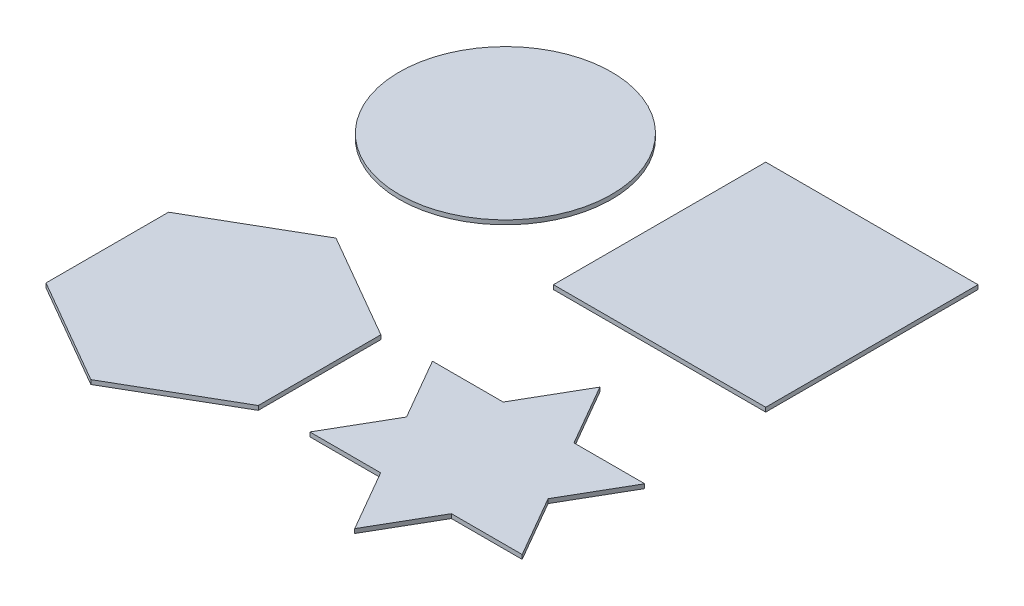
ISO-10303-21;
HEADER;
FILE_DESCRIPTION(('STEP AP214'),'2;1');
FILE_NAME('part.step','',(''),(''),'','','');
FILE_SCHEMA(('AUTOMOTIVE_DESIGN { 1 0 10303 214 1 1 1 1 }'));
ENDSEC;
DATA;
#1=APPLICATION_CONTEXT('core data for automotive mechanical design processes');
#2=APPLICATION_PROTOCOL_DEFINITION('international standard','automotive_design',2000,#1);
#3=PRODUCT_CONTEXT('',#1,'mechanical');
#4=PRODUCT('Part','Part','',(#3));
#5=PRODUCT_RELATED_PRODUCT_CATEGORY('part','',(#4));
#6=PRODUCT_DEFINITION_FORMATION('','',#4);
#7=PRODUCT_DEFINITION_CONTEXT('part definition',#1,'design');
#8=PRODUCT_DEFINITION('design','',#6,#7);
#9=PRODUCT_DEFINITION_SHAPE('','',#8);
#10=(LENGTH_UNIT() NAMED_UNIT(*) SI_UNIT(.MILLI.,.METRE.));
#11=(NAMED_UNIT(*) PLANE_ANGLE_UNIT() SI_UNIT($,.RADIAN.));
#12=(NAMED_UNIT(*) SI_UNIT($,.STERADIAN.) SOLID_ANGLE_UNIT());
#13=UNCERTAINTY_MEASURE_WITH_UNIT(LENGTH_MEASURE(1.E-05),#10,'distance_accuracy_value','');
#14=(GEOMETRIC_REPRESENTATION_CONTEXT(3) GLOBAL_UNCERTAINTY_ASSIGNED_CONTEXT((#13)) GLOBAL_UNIT_ASSIGNED_CONTEXT((#10,
#11,#12)) REPRESENTATION_CONTEXT('',''));
#15=CARTESIAN_POINT('',(0.,0.,0.));
#16=DIRECTION('',(0.,0.,1.));
#17=DIRECTION('',(1.,0.,0.));
#18=AXIS2_PLACEMENT_3D('',#15,#16,#17);
#19=CARTESIAN_POINT('',(62.9014881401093,1.,40.6539728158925));
#20=DIRECTION('',(0.866025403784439,0.,0.5));
#21=DIRECTION('',(0.5,0.,-0.866025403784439));
#22=AXIS2_PLACEMENT_3D('',#19,#20,#21);
#23=PLANE('',#22);
#24=DIRECTION('',(-0.5,0.,0.866025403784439));
#25=VECTOR('',#24,1.);
#26=CARTESIAN_POINT('',(62.9014881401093,0.,40.6539728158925));
#27=LINE('',#26,#25);
#28=CARTESIAN_POINT('',(62.9014881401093,0.,40.6539728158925));
#29=VERTEX_POINT('',#28);
#30=CARTESIAN_POINT('',(54.568154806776,0.,55.0877295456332));
#31=VERTEX_POINT('',#30);
#32=EDGE_CURVE('E162',#29,#31,#27,.T.);
#33=ORIENTED_EDGE('',*,*,#32,.T.);
#34=DIRECTION('',(0.,-1.,0.));
#35=VECTOR('',#34,1.);
#36=CARTESIAN_POINT('',(54.568154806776,1.,55.0877295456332));
#37=LINE('',#36,#35);
#38=CARTESIAN_POINT('',(54.568154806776,1.,55.0877295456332));
#39=VERTEX_POINT('',#38);
#40=EDGE_CURVE('E12',#39,#31,#37,.T.);
#41=ORIENTED_EDGE('',*,*,#40,.F.);
#42=DIRECTION('',(-0.5,0.,0.866025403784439));
#43=VECTOR('',#42,1.);
#44=CARTESIAN_POINT('',(62.9014881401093,1.,40.6539728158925));
#45=LINE('',#44,#43);
#46=CARTESIAN_POINT('',(62.9014881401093,1.,40.6539728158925));
#47=VERTEX_POINT('',#46);
#48=EDGE_CURVE('E184',#47,#39,#45,.T.);
#49=ORIENTED_EDGE('',*,*,#48,.F.);
#50=DIRECTION('',(0.,-1.,0.));
#51=VECTOR('',#50,1.);
#52=CARTESIAN_POINT('',(62.9014881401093,1.,40.6539728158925));
#53=LINE('',#52,#51);
#54=EDGE_CURVE('E158',#47,#29,#53,.T.);
#55=ORIENTED_EDGE('',*,*,#54,.T.);
#56=EDGE_LOOP('',(#33,#41,#49,#55));
#57=FACE_BOUND('',#56,.T.);
#58=ADVANCED_FACE('F42',(#57),#23,.F.);
#59=CARTESIAN_POINT('',(37.9014881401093,1.,55.0877295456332));
#60=DIRECTION('',(0.,0.,1.));
#61=DIRECTION('',(1.,0.,0.));
#62=AXIS2_PLACEMENT_3D('',#59,#60,#61);
#63=PLANE('',#62);
#64=DIRECTION('',(-1.,0.,0.));
#65=VECTOR('',#64,1.);
#66=CARTESIAN_POINT('',(37.9014881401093,0.,55.0877295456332));
#67=LINE('',#66,#65);
#68=CARTESIAN_POINT('',(37.9014881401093,0.,55.0877295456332));
#69=VERTEX_POINT('',#68);
#70=EDGE_CURVE('E165',#31,#69,#67,.T.);
#71=ORIENTED_EDGE('',*,*,#70,.T.);
#72=DIRECTION('',(0.,-1.,0.));
#73=VECTOR('',#72,1.);
#74=CARTESIAN_POINT('',(37.9014881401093,1.,55.0877295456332));
#75=LINE('',#74,#73);
#76=CARTESIAN_POINT('',(37.9014881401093,1.,55.0877295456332));
#77=VERTEX_POINT('',#76);
#78=EDGE_CURVE('E50',#77,#69,#75,.T.);
#79=ORIENTED_EDGE('',*,*,#78,.F.);
#80=DIRECTION('',(-1.,0.,0.));
#81=VECTOR('',#80,1.);
#82=CARTESIAN_POINT('',(37.9014881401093,1.,55.0877295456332));
#83=LINE('',#82,#81);
#84=EDGE_CURVE('E113',#39,#77,#83,.T.);
#85=ORIENTED_EDGE('',*,*,#84,.F.);
#86=ORIENTED_EDGE('',*,*,#40,.T.);
#87=EDGE_LOOP('',(#71,#79,#85,#86));
#88=FACE_BOUND('',#87,.T.);
#89=ADVANCED_FACE('F262',(#88),#63,.F.);
#90=CARTESIAN_POINT('',(37.9014881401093,1.,55.0877295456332));
#91=DIRECTION('',(0.866025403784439,0.,-0.5));
#92=DIRECTION('',(-0.5,0.,-0.866025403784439));
#93=AXIS2_PLACEMENT_3D('',#90,#91,#92);
#94=PLANE('',#93);
#95=DIRECTION('',(0.5,0.,0.866025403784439));
#96=VECTOR('',#95,1.);
#97=CARTESIAN_POINT('',(37.9014881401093,0.,55.0877295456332));
#98=LINE('',#97,#96);
#99=CARTESIAN_POINT('',(46.2348214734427,0.,69.5214862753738));
#100=VERTEX_POINT('',#99);
#101=EDGE_CURVE('E167',#69,#100,#98,.T.);
#102=ORIENTED_EDGE('',*,*,#101,.T.);
#103=DIRECTION('',(0.,-1.,0.));
#104=VECTOR('',#103,1.);
#105=CARTESIAN_POINT('',(46.2348214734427,1.,69.5214862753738));
#106=LINE('',#105,#104);
#107=CARTESIAN_POINT('',(46.2348214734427,1.,69.5214862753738));
#108=VERTEX_POINT('',#107);
#109=EDGE_CURVE('E203',#108,#100,#106,.T.);
#110=ORIENTED_EDGE('',*,*,#109,.F.);
#111=DIRECTION('',(0.5,0.,0.866025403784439));
#112=VECTOR('',#111,1.);
#113=CARTESIAN_POINT('',(37.9014881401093,1.,55.0877295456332));
#114=LINE('',#113,#112);
#115=EDGE_CURVE('E211',#77,#108,#114,.T.);
#116=ORIENTED_EDGE('',*,*,#115,.F.);
#117=ORIENTED_EDGE('',*,*,#78,.T.);
#118=EDGE_LOOP('',(#102,#110,#116,#117));
#119=FACE_BOUND('',#118,.T.);
#120=ADVANCED_FACE('F209',(#119),#94,.F.);
#121=CARTESIAN_POINT('',(46.2348214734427,1.,69.5214862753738));
#122=DIRECTION('',(0.866025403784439,0.,0.5));
#123=DIRECTION('',(0.5,0.,-0.866025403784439));
#124=AXIS2_PLACEMENT_3D('',#121,#122,#123);
#125=PLANE('',#124);
#126=DIRECTION('',(-0.5,0.,0.866025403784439));
#127=VECTOR('',#126,1.);
#128=CARTESIAN_POINT('',(46.2348214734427,0.,69.5214862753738));
#129=LINE('',#128,#127);
#130=CARTESIAN_POINT('',(37.9014881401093,0.,83.9552430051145));
#131=VERTEX_POINT('',#130);
#132=EDGE_CURVE('E169',#100,#131,#129,.T.);
#133=ORIENTED_EDGE('',*,*,#132,.T.);
#134=DIRECTION('',(0.,-1.,0.));
#135=VECTOR('',#134,1.);
#136=CARTESIAN_POINT('',(37.9014881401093,1.,83.9552430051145));
#137=LINE('',#136,#135);
#138=CARTESIAN_POINT('',(37.9014881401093,1.,83.9552430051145));
#139=VERTEX_POINT('',#138);
#140=EDGE_CURVE('E200',#139,#131,#137,.T.);
#141=ORIENTED_EDGE('',*,*,#140,.F.);
#142=DIRECTION('',(-0.5,0.,0.866025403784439));
#143=VECTOR('',#142,1.);
#144=CARTESIAN_POINT('',(46.2348214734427,1.,69.5214862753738));
#145=LINE('',#144,#143);
#146=EDGE_CURVE('E229',#108,#139,#145,.T.);
#147=ORIENTED_EDGE('',*,*,#146,.F.);
#148=ORIENTED_EDGE('',*,*,#109,.T.);
#149=EDGE_LOOP('',(#133,#141,#147,#148));
#150=FACE_BOUND('',#149,.T.);
#151=ADVANCED_FACE('F220',(#150),#125,.F.);
#152=CARTESIAN_POINT('',(37.9014881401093,1.,83.9552430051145));
#153=DIRECTION('',(0.,0.,-1.));
#154=DIRECTION('',(-1.,0.,0.));
#155=AXIS2_PLACEMENT_3D('',#152,#153,#154);
#156=PLANE('',#155);
#157=DIRECTION('',(1.,0.,0.));
#158=VECTOR('',#157,1.);
#159=CARTESIAN_POINT('',(37.9014881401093,0.,83.9552430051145));
#160=LINE('',#159,#158);
#161=CARTESIAN_POINT('',(54.568154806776,0.,83.9552430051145));
#162=VERTEX_POINT('',#161);
#163=EDGE_CURVE('E171',#131,#162,#160,.T.);
#164=ORIENTED_EDGE('',*,*,#163,.T.);
#165=DIRECTION('',(0.,-1.,0.));
#166=VECTOR('',#165,1.);
#167=CARTESIAN_POINT('',(54.568154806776,1.,83.9552430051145));
#168=LINE('',#167,#166);
#169=CARTESIAN_POINT('',(54.568154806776,1.,83.9552430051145));
#170=VERTEX_POINT('',#169);
#171=EDGE_CURVE('E197',#170,#162,#168,.T.);
#172=ORIENTED_EDGE('',*,*,#171,.F.);
#173=DIRECTION('',(1.,0.,0.));
#174=VECTOR('',#173,1.);
#175=CARTESIAN_POINT('',(37.9014881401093,1.,83.9552430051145));
#176=LINE('',#175,#174);
#177=EDGE_CURVE('E226',#139,#170,#176,.T.);
#178=ORIENTED_EDGE('',*,*,#177,.F.);
#179=ORIENTED_EDGE('',*,*,#140,.T.);
#180=EDGE_LOOP('',(#164,#172,#178,#179));
#181=FACE_BOUND('',#180,.T.);
#182=ADVANCED_FACE('F224',(#181),#156,.F.);
#183=CARTESIAN_POINT('',(54.568154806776,1.,83.9552430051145));
#184=DIRECTION('',(0.866025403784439,0.,-0.5));
#185=DIRECTION('',(-0.5,0.,-0.866025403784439));
#186=AXIS2_PLACEMENT_3D('',#183,#184,#185);
#187=PLANE('',#186);
#188=DIRECTION('',(0.5,0.,0.866025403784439));
#189=VECTOR('',#188,1.);
#190=CARTESIAN_POINT('',(54.568154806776,0.,83.9552430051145));
#191=LINE('',#190,#189);
#192=CARTESIAN_POINT('',(62.9014881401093,0.,98.3889997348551));
#193=VERTEX_POINT('',#192);
#194=EDGE_CURVE('E173',#162,#193,#191,.T.);
#195=ORIENTED_EDGE('',*,*,#194,.T.);
#196=DIRECTION('',(0.,-1.,0.));
#197=VECTOR('',#196,1.);
#198=CARTESIAN_POINT('',(62.9014881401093,1.,98.3889997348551));
#199=LINE('',#198,#197);
#200=CARTESIAN_POINT('',(62.9014881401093,1.,98.3889997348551));
#201=VERTEX_POINT('',#200);
#202=EDGE_CURVE('E194',#201,#193,#199,.T.);
#203=ORIENTED_EDGE('',*,*,#202,.F.);
#204=DIRECTION('',(0.5,0.,0.866025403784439));
#205=VECTOR('',#204,1.);
#206=CARTESIAN_POINT('',(54.568154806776,1.,83.9552430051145));
#207=LINE('',#206,#205);
#208=EDGE_CURVE('E228',#170,#201,#207,.T.);
#209=ORIENTED_EDGE('',*,*,#208,.F.);
#210=ORIENTED_EDGE('',*,*,#171,.T.);
#211=EDGE_LOOP('',(#195,#203,#209,#210));
#212=FACE_BOUND('',#211,.T.);
#213=ADVANCED_FACE('F275',(#212),#187,.F.);
#214=CARTESIAN_POINT('',(71.2348214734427,1.,83.9552430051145));
#215=DIRECTION('',(-0.866025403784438,0.,-0.5));
#216=DIRECTION('',(-0.5,0.,0.866025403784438));
#217=AXIS2_PLACEMENT_3D('',#214,#215,#216);
#218=PLANE('',#217);
#219=DIRECTION('',(0.5,0.,-0.866025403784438));
#220=VECTOR('',#219,1.);
#221=CARTESIAN_POINT('',(71.2348214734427,0.,83.9552430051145));
#222=LINE('',#221,#220);
#223=CARTESIAN_POINT('',(71.2348214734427,0.,83.9552430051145));
#224=VERTEX_POINT('',#223);
#225=EDGE_CURVE('E175',#193,#224,#222,.T.);
#226=ORIENTED_EDGE('',*,*,#225,.T.);
#227=DIRECTION('',(0.,-1.,0.));
#228=VECTOR('',#227,1.);
#229=CARTESIAN_POINT('',(71.2348214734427,1.,83.9552430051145));
#230=LINE('',#229,#228);
#231=CARTESIAN_POINT('',(71.2348214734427,1.,83.9552430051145));
#232=VERTEX_POINT('',#231);
#233=EDGE_CURVE('E191',#232,#224,#230,.T.);
#234=ORIENTED_EDGE('',*,*,#233,.F.);
#235=DIRECTION('',(0.5,0.,-0.866025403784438));
#236=VECTOR('',#235,1.);
#237=CARTESIAN_POINT('',(71.2348214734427,1.,83.9552430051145));
#238=LINE('',#237,#236);
#239=EDGE_CURVE('E231',#201,#232,#238,.T.);
#240=ORIENTED_EDGE('',*,*,#239,.F.);
#241=ORIENTED_EDGE('',*,*,#202,.T.);
#242=EDGE_LOOP('',(#226,#234,#240,#241));
#243=FACE_BOUND('',#242,.T.);
#244=ADVANCED_FACE('F278',(#243),#218,.F.);
#245=CARTESIAN_POINT('',(71.2348214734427,1.,83.9552430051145));
#246=DIRECTION('',(0.,0.,-1.));
#247=DIRECTION('',(-1.,0.,0.));
#248=AXIS2_PLACEMENT_3D('',#245,#246,#247);
#249=PLANE('',#248);
#250=DIRECTION('',(1.,0.,0.));
#251=VECTOR('',#250,1.);
#252=CARTESIAN_POINT('',(71.2348214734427,0.,83.9552430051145));
#253=LINE('',#252,#251);
#254=CARTESIAN_POINT('',(87.9014881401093,0.,83.9552430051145));
#255=VERTEX_POINT('',#254);
#256=EDGE_CURVE('E177',#224,#255,#253,.T.);
#257=ORIENTED_EDGE('',*,*,#256,.T.);
#258=DIRECTION('',(0.,-1.,0.));
#259=VECTOR('',#258,1.);
#260=CARTESIAN_POINT('',(87.9014881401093,1.,83.9552430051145));
#261=LINE('',#260,#259);
#262=CARTESIAN_POINT('',(87.9014881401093,1.,83.9552430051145));
#263=VERTEX_POINT('',#262);
#264=EDGE_CURVE('E188',#263,#255,#261,.T.);
#265=ORIENTED_EDGE('',*,*,#264,.F.);
#266=DIRECTION('',(1.,0.,0.));
#267=VECTOR('',#266,1.);
#268=CARTESIAN_POINT('',(71.2348214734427,1.,83.9552430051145));
#269=LINE('',#268,#267);
#270=EDGE_CURVE('E237',#232,#263,#269,.T.);
#271=ORIENTED_EDGE('',*,*,#270,.F.);
#272=ORIENTED_EDGE('',*,*,#233,.T.);
#273=EDGE_LOOP('',(#257,#265,#271,#272));
#274=FACE_BOUND('',#273,.T.);
#275=ADVANCED_FACE('F243',(#274),#249,.F.);
#276=CARTESIAN_POINT('',(79.568154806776,1.,69.5214862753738));
#277=DIRECTION('',(-0.866025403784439,0.,0.499999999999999));
#278=DIRECTION('',(0.499999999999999,0.,0.866025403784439));
#279=AXIS2_PLACEMENT_3D('',#276,#277,#278);
#280=PLANE('',#279);
#281=DIRECTION('',(-0.5,0.,-0.866025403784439));
#282=VECTOR('',#281,1.);
#283=CARTESIAN_POINT('',(79.568154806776,0.,69.5214862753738));
#284=LINE('',#283,#282);
#285=CARTESIAN_POINT('',(79.568154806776,0.,69.5214862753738));
#286=VERTEX_POINT('',#285);
#287=EDGE_CURVE('E179',#255,#286,#284,.T.);
#288=ORIENTED_EDGE('',*,*,#287,.T.);
#289=DIRECTION('',(0.,-1.,0.));
#290=VECTOR('',#289,1.);
#291=CARTESIAN_POINT('',(79.568154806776,1.,69.5214862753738));
#292=LINE('',#291,#290);
#293=CARTESIAN_POINT('',(79.568154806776,1.,69.5214862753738));
#294=VERTEX_POINT('',#293);
#295=EDGE_CURVE('E153',#294,#286,#292,.T.);
#296=ORIENTED_EDGE('',*,*,#295,.F.);
#297=DIRECTION('',(-0.5,0.,-0.866025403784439));
#298=VECTOR('',#297,1.);
#299=CARTESIAN_POINT('',(79.568154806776,1.,69.5214862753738));
#300=LINE('',#299,#298);
#301=EDGE_CURVE('E144',#263,#294,#300,.T.);
#302=ORIENTED_EDGE('',*,*,#301,.F.);
#303=ORIENTED_EDGE('',*,*,#264,.T.);
#304=EDGE_LOOP('',(#288,#296,#302,#303));
#305=FACE_BOUND('',#304,.T.);
#306=ADVANCED_FACE('F247',(#305),#280,.F.);
#307=CARTESIAN_POINT('',(87.9014881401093,1.,55.0877295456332));
#308=DIRECTION('',(-0.866025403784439,0.,-0.5));
#309=DIRECTION('',(-0.5,0.,0.866025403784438));
#310=AXIS2_PLACEMENT_3D('',#307,#308,#309);
#311=PLANE('',#310);
#312=DIRECTION('',(0.5,0.,-0.866025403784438));
#313=VECTOR('',#312,1.);
#314=CARTESIAN_POINT('',(87.9014881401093,0.,55.0877295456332));
#315=LINE('',#314,#313);
#316=CARTESIAN_POINT('',(87.9014881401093,0.,55.0877295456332));
#317=VERTEX_POINT('',#316);
#318=EDGE_CURVE('E152',#286,#317,#315,.T.);
#319=ORIENTED_EDGE('',*,*,#318,.T.);
#320=DIRECTION('',(0.,-1.,0.));
#321=VECTOR('',#320,1.);
#322=CARTESIAN_POINT('',(87.9014881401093,1.,55.0877295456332));
#323=LINE('',#322,#321);
#324=CARTESIAN_POINT('',(87.9014881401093,1.,55.0877295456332));
#325=VERTEX_POINT('',#324);
#326=EDGE_CURVE('E149',#325,#317,#323,.T.);
#327=ORIENTED_EDGE('',*,*,#326,.F.);
#328=DIRECTION('',(0.5,0.,-0.866025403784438));
#329=VECTOR('',#328,1.);
#330=CARTESIAN_POINT('',(87.9014881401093,1.,55.0877295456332));
#331=LINE('',#330,#329);
#332=EDGE_CURVE('E138',#294,#325,#331,.T.);
#333=ORIENTED_EDGE('',*,*,#332,.F.);
#334=ORIENTED_EDGE('',*,*,#295,.T.);
#335=EDGE_LOOP('',(#319,#327,#333,#334));
#336=FACE_BOUND('',#335,.T.);
#337=ADVANCED_FACE('F150',(#336),#311,.F.);
#338=CARTESIAN_POINT('',(71.2348214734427,1.,55.0877295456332));
#339=DIRECTION('',(0.,0.,1.));
#340=DIRECTION('',(1.,0.,0.));
#341=AXIS2_PLACEMENT_3D('',#338,#339,#340);
#342=PLANE('',#341);
#343=DIRECTION('',(-1.,0.,0.));
#344=VECTOR('',#343,1.);
#345=CARTESIAN_POINT('',(71.2348214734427,0.,55.0877295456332));
#346=LINE('',#345,#344);
#347=CARTESIAN_POINT('',(71.2348214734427,0.,55.0877295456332));
#348=VERTEX_POINT('',#347);
#349=EDGE_CURVE('E99',#317,#348,#346,.T.);
#350=ORIENTED_EDGE('',*,*,#349,.T.);
#351=DIRECTION('',(0.,-1.,0.));
#352=VECTOR('',#351,1.);
#353=CARTESIAN_POINT('',(71.2348214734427,1.,55.0877295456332));
#354=LINE('',#353,#352);
#355=CARTESIAN_POINT('',(71.2348214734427,1.,55.0877295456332));
#356=VERTEX_POINT('',#355);
#357=EDGE_CURVE('E154',#356,#348,#354,.T.);
#358=ORIENTED_EDGE('',*,*,#357,.F.);
#359=DIRECTION('',(-1.,0.,0.));
#360=VECTOR('',#359,1.);
#361=CARTESIAN_POINT('',(71.2348214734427,1.,55.0877295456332));
#362=LINE('',#361,#360);
#363=EDGE_CURVE('E142',#325,#356,#362,.T.);
#364=ORIENTED_EDGE('',*,*,#363,.F.);
#365=ORIENTED_EDGE('',*,*,#326,.T.);
#366=EDGE_LOOP('',(#350,#358,#364,#365));
#367=FACE_BOUND('',#366,.T.);
#368=ADVANCED_FACE('F156',(#367),#342,.F.);
#369=CARTESIAN_POINT('',(62.9014881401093,1.,40.6539728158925));
#370=DIRECTION('',(-0.866025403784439,0.,0.5));
#371=DIRECTION('',(0.5,0.,0.866025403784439));
#372=AXIS2_PLACEMENT_3D('',#369,#370,#371);
#373=PLANE('',#372);
#374=DIRECTION('',(-0.5,0.,-0.866025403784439));
#375=VECTOR('',#374,1.);
#376=CARTESIAN_POINT('',(62.9014881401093,0.,40.6539728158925));
#377=LINE('',#376,#375);
#378=EDGE_CURVE('E105',#348,#29,#377,.T.);
#379=ORIENTED_EDGE('',*,*,#378,.T.);
#380=ORIENTED_EDGE('',*,*,#54,.F.);
#381=DIRECTION('',(-0.5,0.,-0.866025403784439));
#382=VECTOR('',#381,1.);
#383=CARTESIAN_POINT('',(62.9014881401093,1.,40.6539728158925));
#384=LINE('',#383,#382);
#385=EDGE_CURVE('E58',#356,#47,#384,.T.);
#386=ORIENTED_EDGE('',*,*,#385,.F.);
#387=ORIENTED_EDGE('',*,*,#357,.T.);
#388=EDGE_LOOP('',(#379,#380,#386,#387));
#389=FACE_BOUND('',#388,.T.);
#390=ADVANCED_FACE('F251',(#389),#373,.F.);
#391=CARTESIAN_POINT('',(54.568154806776,1.,55.0877295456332));
#392=DIRECTION('',(0.,1.,0.));
#393=DIRECTION('',(0.,0.,1.));
#394=AXIS2_PLACEMENT_3D('',#391,#392,#393);
#395=PLANE('',#394);
#396=ORIENTED_EDGE('',*,*,#48,.T.);
#397=ORIENTED_EDGE('',*,*,#84,.T.);
#398=ORIENTED_EDGE('',*,*,#115,.T.);
#399=ORIENTED_EDGE('',*,*,#146,.T.);
#400=ORIENTED_EDGE('',*,*,#177,.T.);
#401=ORIENTED_EDGE('',*,*,#208,.T.);
#402=ORIENTED_EDGE('',*,*,#239,.T.);
#403=ORIENTED_EDGE('',*,*,#270,.T.);
#404=ORIENTED_EDGE('',*,*,#301,.T.);
#405=ORIENTED_EDGE('',*,*,#332,.T.);
#406=ORIENTED_EDGE('',*,*,#363,.T.);
#407=ORIENTED_EDGE('',*,*,#385,.T.);
#408=EDGE_LOOP('',(#396,#397,#398,#399,#400,#401,#402,#403,#404,#405,#406,#407));
#409=FACE_BOUND('',#408,.T.);
#410=ADVANCED_FACE('F140',(#409),#395,.T.);
#411=CARTESIAN_POINT('',(54.568154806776,0.,55.0877295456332));
#412=DIRECTION('',(0.,1.,0.));
#413=DIRECTION('',(0.,0.,1.));
#414=AXIS2_PLACEMENT_3D('',#411,#412,#413);
#415=PLANE('',#414);
#416=ORIENTED_EDGE('',*,*,#32,.F.);
#417=ORIENTED_EDGE('',*,*,#378,.F.);
#418=ORIENTED_EDGE('',*,*,#349,.F.);
#419=ORIENTED_EDGE('',*,*,#318,.F.);
#420=ORIENTED_EDGE('',*,*,#287,.F.);
#421=ORIENTED_EDGE('',*,*,#256,.F.);
#422=ORIENTED_EDGE('',*,*,#225,.F.);
#423=ORIENTED_EDGE('',*,*,#194,.F.);
#424=ORIENTED_EDGE('',*,*,#163,.F.);
#425=ORIENTED_EDGE('',*,*,#132,.F.);
#426=ORIENTED_EDGE('',*,*,#101,.F.);
#427=ORIENTED_EDGE('',*,*,#70,.F.);
#428=EDGE_LOOP('',(#416,#417,#418,#419,#420,#421,#422,#423,#424,#425,#426,#427));
#429=FACE_BOUND('',#428,.T.);
#430=ADVANCED_FACE('F215',(#429),#415,.F.);
#431=CLOSED_SHELL('',(#58,#89,#120,#151,#182,#213,#244,#275,#306,#337,#368,#390,#410,#430));
#432=MANIFOLD_SOLID_BREP('B2',#431);
#433=CARTESIAN_POINT('',(26.4283937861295,1.,55.7690727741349));
#434=DIRECTION('',(-0.5,0.,0.866025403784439));
#435=DIRECTION('',(0.866025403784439,0.,0.5));
#436=AXIS2_PLACEMENT_3D('',#433,#434,#435);
#437=PLANE('',#436);
#438=DIRECTION('',(-0.866025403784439,0.,-0.5));
#439=VECTOR('',#438,1.);
#440=CARTESIAN_POINT('',(26.4283937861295,0.,55.7690727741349));
#441=LINE('',#440,#439);
#442=CARTESIAN_POINT('',(26.4283937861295,0.,55.7690727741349));
#443=VERTEX_POINT('',#442);
#444=CARTESIAN_POINT('',(1.42839378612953,0.,41.3353160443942));
#445=VERTEX_POINT('',#444);
#446=EDGE_CURVE('E468',#443,#445,#441,.T.);
#447=ORIENTED_EDGE('',*,*,#446,.T.);
#448=DIRECTION('',(0.,-1.,0.));
#449=VECTOR('',#448,1.);
#450=CARTESIAN_POINT('',(1.42839378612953,1.,41.3353160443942));
#451=LINE('',#450,#449);
#452=CARTESIAN_POINT('',(1.42839378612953,1.,41.3353160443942));
#453=VERTEX_POINT('',#452);
#454=EDGE_CURVE('E40',#453,#445,#451,.T.);
#455=ORIENTED_EDGE('',*,*,#454,.F.);
#456=DIRECTION('',(-0.866025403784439,0.,-0.5));
#457=VECTOR('',#456,1.);
#458=CARTESIAN_POINT('',(26.4283937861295,1.,55.7690727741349));
#459=LINE('',#458,#457);
#460=CARTESIAN_POINT('',(26.4283937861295,1.,55.7690727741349));
#461=VERTEX_POINT('',#460);
#462=EDGE_CURVE('E478',#461,#453,#459,.T.);
#463=ORIENTED_EDGE('',*,*,#462,.F.);
#464=DIRECTION('',(0.,-1.,0.));
#465=VECTOR('',#464,1.);
#466=CARTESIAN_POINT('',(26.4283937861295,1.,55.7690727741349));
#467=LINE('',#466,#465);
#468=EDGE_CURVE('E464',#461,#443,#467,.T.);
#469=ORIENTED_EDGE('',*,*,#468,.T.);
#470=EDGE_LOOP('',(#447,#455,#463,#469));
#471=FACE_BOUND('',#470,.T.);
#472=ADVANCED_FACE('F384',(#471),#437,.F.);
#473=CARTESIAN_POINT('',(1.42839378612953,1.,41.3353160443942));
#474=DIRECTION('',(0.5,0.,0.866025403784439));
#475=DIRECTION('',(0.866025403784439,0.,-0.5));
#476=AXIS2_PLACEMENT_3D('',#473,#474,#475);
#477=PLANE('',#476);
#478=DIRECTION('',(-0.866025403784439,0.,0.5));
#479=VECTOR('',#478,1.);
#480=CARTESIAN_POINT('',(1.42839378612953,0.,41.3353160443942));
#481=LINE('',#480,#479);
#482=CARTESIAN_POINT('',(-23.5716062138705,0.,55.7690727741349));
#483=VERTEX_POINT('',#482);
#484=EDGE_CURVE('E471',#445,#483,#481,.T.);
#485=ORIENTED_EDGE('',*,*,#484,.T.);
#486=DIRECTION('',(0.,-1.,0.));
#487=VECTOR('',#486,1.);
#488=CARTESIAN_POINT('',(-23.5716062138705,1.,55.7690727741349));
#489=LINE('',#488,#487);
#490=CARTESIAN_POINT('',(-23.5716062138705,1.,55.7690727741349));
#491=VERTEX_POINT('',#490);
#492=EDGE_CURVE('E392',#491,#483,#489,.T.);
#493=ORIENTED_EDGE('',*,*,#492,.F.);
#494=DIRECTION('',(-0.866025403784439,0.,0.5));
#495=VECTOR('',#494,1.);
#496=CARTESIAN_POINT('',(1.42839378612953,1.,41.3353160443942));
#497=LINE('',#496,#495);
#498=EDGE_CURVE('E437',#453,#491,#497,.T.);
#499=ORIENTED_EDGE('',*,*,#498,.F.);
#500=ORIENTED_EDGE('',*,*,#454,.T.);
#501=EDGE_LOOP('',(#485,#493,#499,#500));
#502=FACE_BOUND('',#501,.T.);
#503=ADVANCED_FACE('F502',(#502),#477,.F.);
#504=CARTESIAN_POINT('',(-23.5716062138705,1.,55.7690727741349));
#505=DIRECTION('',(1.,0.,0.));
#506=DIRECTION('',(0.,0.,-1.));
#507=AXIS2_PLACEMENT_3D('',#504,#505,#506);
#508=PLANE('',#507);
#509=DIRECTION('',(0.,0.,1.));
#510=VECTOR('',#509,1.);
#511=CARTESIAN_POINT('',(-23.5716062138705,0.,55.7690727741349));
#512=LINE('',#511,#510);
#513=CARTESIAN_POINT('',(-23.5716062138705,0.,84.6365862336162));
#514=VERTEX_POINT('',#513);
#515=EDGE_CURVE('E473',#483,#514,#512,.T.);
#516=ORIENTED_EDGE('',*,*,#515,.T.);
#517=DIRECTION('',(0.,-1.,0.));
#518=VECTOR('',#517,1.);
#519=CARTESIAN_POINT('',(-23.5716062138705,1.,84.6365862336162));
#520=LINE('',#519,#518);
#521=CARTESIAN_POINT('',(-23.5716062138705,1.,84.6365862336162));
#522=VERTEX_POINT('',#521);
#523=EDGE_CURVE('E459',#522,#514,#520,.T.);
#524=ORIENTED_EDGE('',*,*,#523,.F.);
#525=DIRECTION('',(0.,0.,1.));
#526=VECTOR('',#525,1.);
#527=CARTESIAN_POINT('',(-23.5716062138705,1.,55.7690727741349));
#528=LINE('',#527,#526);
#529=EDGE_CURVE('E450',#491,#522,#528,.T.);
#530=ORIENTED_EDGE('',*,*,#529,.F.);
#531=ORIENTED_EDGE('',*,*,#492,.T.);
#532=EDGE_LOOP('',(#516,#524,#530,#531));
#533=FACE_BOUND('',#532,.T.);
#534=ADVANCED_FACE('F484',(#533),#508,.F.);
#535=CARTESIAN_POINT('',(-23.5716062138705,1.,84.6365862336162));
#536=DIRECTION('',(0.5,0.,-0.866025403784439));
#537=DIRECTION('',(-0.866025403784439,0.,-0.5));
#538=AXIS2_PLACEMENT_3D('',#535,#536,#537);
#539=PLANE('',#538);
#540=DIRECTION('',(0.866025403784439,0.,0.5));
#541=VECTOR('',#540,1.);
#542=CARTESIAN_POINT('',(-23.5716062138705,0.,84.6365862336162));
#543=LINE('',#542,#541);
#544=CARTESIAN_POINT('',(1.42839378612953,0.,99.0703429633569));
#545=VERTEX_POINT('',#544);
#546=EDGE_CURVE('E458',#514,#545,#543,.T.);
#547=ORIENTED_EDGE('',*,*,#546,.T.);
#548=DIRECTION('',(0.,-1.,0.));
#549=VECTOR('',#548,1.);
#550=CARTESIAN_POINT('',(1.42839378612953,1.,99.0703429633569));
#551=LINE('',#550,#549);
#552=CARTESIAN_POINT('',(1.42839378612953,1.,99.0703429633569));
#553=VERTEX_POINT('',#552);
#554=EDGE_CURVE('E455',#553,#545,#551,.T.);
#555=ORIENTED_EDGE('',*,*,#554,.F.);
#556=DIRECTION('',(0.866025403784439,0.,0.5));
#557=VECTOR('',#556,1.);
#558=CARTESIAN_POINT('',(-23.5716062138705,1.,84.6365862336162));
#559=LINE('',#558,#557);
#560=EDGE_CURVE('E444',#522,#553,#559,.T.);
#561=ORIENTED_EDGE('',*,*,#560,.F.);
#562=ORIENTED_EDGE('',*,*,#523,.T.);
#563=EDGE_LOOP('',(#547,#555,#561,#562));
#564=FACE_BOUND('',#563,.T.);
#565=ADVANCED_FACE('F456',(#564),#539,.F.);
#566=CARTESIAN_POINT('',(1.42839378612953,1.,99.0703429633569));
#567=DIRECTION('',(-0.5,0.,-0.866025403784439));
#568=DIRECTION('',(-0.866025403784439,0.,0.5));
#569=AXIS2_PLACEMENT_3D('',#566,#567,#568);
#570=PLANE('',#569);
#571=DIRECTION('',(0.866025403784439,0.,-0.5));
#572=VECTOR('',#571,1.);
#573=CARTESIAN_POINT('',(1.42839378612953,0.,99.0703429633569));
#574=LINE('',#573,#572);
#575=CARTESIAN_POINT('',(26.4283937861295,0.,84.6365862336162));
#576=VERTEX_POINT('',#575);
#577=EDGE_CURVE('E423',#545,#576,#574,.T.);
#578=ORIENTED_EDGE('',*,*,#577,.T.);
#579=DIRECTION('',(0.,-1.,0.));
#580=VECTOR('',#579,1.);
#581=CARTESIAN_POINT('',(26.4283937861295,1.,84.6365862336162));
#582=LINE('',#581,#580);
#583=CARTESIAN_POINT('',(26.4283937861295,1.,84.6365862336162));
#584=VERTEX_POINT('',#583);
#585=EDGE_CURVE('E460',#584,#576,#582,.T.);
#586=ORIENTED_EDGE('',*,*,#585,.F.);
#587=DIRECTION('',(0.866025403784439,0.,-0.5));
#588=VECTOR('',#587,1.);
#589=CARTESIAN_POINT('',(1.42839378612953,1.,99.0703429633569));
#590=LINE('',#589,#588);
#591=EDGE_CURVE('E448',#553,#584,#590,.T.);
#592=ORIENTED_EDGE('',*,*,#591,.F.);
#593=ORIENTED_EDGE('',*,*,#554,.T.);
#594=EDGE_LOOP('',(#578,#586,#592,#593));
#595=FACE_BOUND('',#594,.T.);
#596=ADVANCED_FACE('F462',(#595),#570,.F.);
#597=CARTESIAN_POINT('',(26.4283937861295,1.,84.6365862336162));
#598=DIRECTION('',(-1.,0.,0.));
#599=DIRECTION('',(0.,0.,1.));
#600=AXIS2_PLACEMENT_3D('',#597,#598,#599);
#601=PLANE('',#600);
#602=DIRECTION('',(0.,0.,-1.));
#603=VECTOR('',#602,1.);
#604=CARTESIAN_POINT('',(26.4283937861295,0.,84.6365862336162));
#605=LINE('',#604,#603);
#606=EDGE_CURVE('E429',#576,#443,#605,.T.);
#607=ORIENTED_EDGE('',*,*,#606,.T.);
#608=ORIENTED_EDGE('',*,*,#468,.F.);
#609=DIRECTION('',(0.,0.,-1.));
#610=VECTOR('',#609,1.);
#611=CARTESIAN_POINT('',(26.4283937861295,1.,84.6365862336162));
#612=LINE('',#611,#610);
#613=EDGE_CURVE('E400',#584,#461,#612,.T.);
#614=ORIENTED_EDGE('',*,*,#613,.F.);
#615=ORIENTED_EDGE('',*,*,#585,.T.);
#616=EDGE_LOOP('',(#607,#608,#614,#615));
#617=FACE_BOUND('',#616,.T.);
#618=ADVANCED_FACE('F491',(#617),#601,.F.);
#619=CARTESIAN_POINT('',(1.42839378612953,1.,41.3353160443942));
#620=DIRECTION('',(0.,1.,0.));
#621=DIRECTION('',(0.,0.,1.));
#622=AXIS2_PLACEMENT_3D('',#619,#620,#621);
#623=PLANE('',#622);
#624=ORIENTED_EDGE('',*,*,#462,.T.);
#625=ORIENTED_EDGE('',*,*,#498,.T.);
#626=ORIENTED_EDGE('',*,*,#529,.T.);
#627=ORIENTED_EDGE('',*,*,#560,.T.);
#628=ORIENTED_EDGE('',*,*,#591,.T.);
#629=ORIENTED_EDGE('',*,*,#613,.T.);
#630=EDGE_LOOP('',(#624,#625,#626,#627,#628,#629));
#631=FACE_BOUND('',#630,.T.);
#632=ADVANCED_FACE('F446',(#631),#623,.T.);
#633=CARTESIAN_POINT('',(1.42839378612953,0.,41.3353160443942));
#634=DIRECTION('',(0.,1.,0.));
#635=DIRECTION('',(0.,0.,1.));
#636=AXIS2_PLACEMENT_3D('',#633,#634,#635);
#637=PLANE('',#636);
#638=ORIENTED_EDGE('',*,*,#446,.F.);
#639=ORIENTED_EDGE('',*,*,#606,.F.);
#640=ORIENTED_EDGE('',*,*,#577,.F.);
#641=ORIENTED_EDGE('',*,*,#546,.F.);
#642=ORIENTED_EDGE('',*,*,#515,.F.);
#643=ORIENTED_EDGE('',*,*,#484,.F.);
#644=EDGE_LOOP('',(#638,#639,#640,#641,#642,#643));
#645=FACE_BOUND('',#644,.T.);
#646=ADVANCED_FACE('F487',(#645),#637,.F.);
#647=CLOSED_SHELL('',(#472,#503,#534,#565,#596,#618,#632,#646));
#648=MANIFOLD_SOLID_BREP('B6',#647);
#649=CARTESIAN_POINT('',(36.5433218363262,1.,-24.7674171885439));
#650=DIRECTION('',(1.,0.,0.));
#651=DIRECTION('',(0.,0.,-1.));
#652=AXIS2_PLACEMENT_3D('',#649,#650,#651);
#653=PLANE('',#652);
#654=DIRECTION('',(0.,0.,1.));
#655=VECTOR('',#654,1.);
#656=CARTESIAN_POINT('',(36.5433218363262,0.,-24.7674171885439));
#657=LINE('',#656,#655);
#658=CARTESIAN_POINT('',(36.5433218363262,0.,-24.7674171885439));
#659=VERTEX_POINT('',#658);
#660=CARTESIAN_POINT('',(36.5433218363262,0.,25.2325828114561));
#661=VERTEX_POINT('',#660);
#662=EDGE_CURVE('E630',#659,#661,#657,.T.);
#663=ORIENTED_EDGE('',*,*,#662,.T.);
#664=DIRECTION('',(0.,-1.,0.));
#665=VECTOR('',#664,1.);
#666=CARTESIAN_POINT('',(36.5433218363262,1.,25.2325828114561));
#667=LINE('',#666,#665);
#668=CARTESIAN_POINT('',(36.5433218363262,1.,25.2325828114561));
#669=VERTEX_POINT('',#668);
#670=EDGE_CURVE('E382',#669,#661,#667,.T.);
#671=ORIENTED_EDGE('',*,*,#670,.F.);
#672=DIRECTION('',(0.,0.,1.));
#673=VECTOR('',#672,1.);
#674=CARTESIAN_POINT('',(36.5433218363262,1.,-24.7674171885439));
#675=LINE('',#674,#673);
#676=CARTESIAN_POINT('',(36.5433218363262,1.,-24.7674171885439));
#677=VERTEX_POINT('',#676);
#678=EDGE_CURVE('E618',#677,#669,#675,.T.);
#679=ORIENTED_EDGE('',*,*,#678,.F.);
#680=DIRECTION('',(0.,-1.,0.));
#681=VECTOR('',#680,1.);
#682=CARTESIAN_POINT('',(36.5433218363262,1.,-24.7674171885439));
#683=LINE('',#682,#681);
#684=EDGE_CURVE('E626',#677,#659,#683,.T.);
#685=ORIENTED_EDGE('',*,*,#684,.T.);
#686=EDGE_LOOP('',(#663,#671,#679,#685));
#687=FACE_BOUND('',#686,.T.);
#688=ADVANCED_FACE('F567',(#687),#653,.F.);
#689=CARTESIAN_POINT('',(36.5433218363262,1.,25.2325828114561));
#690=DIRECTION('',(0.,0.,-1.));
#691=DIRECTION('',(-1.,0.,0.));
#692=AXIS2_PLACEMENT_3D('',#689,#690,#691);
#693=PLANE('',#692);
#694=DIRECTION('',(1.,0.,0.));
#695=VECTOR('',#694,1.);
#696=CARTESIAN_POINT('',(36.5433218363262,0.,25.2325828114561));
#697=LINE('',#696,#695);
#698=CARTESIAN_POINT('',(86.5433218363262,0.,25.2325828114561));
#699=VERTEX_POINT('',#698);
#700=EDGE_CURVE('E622',#661,#699,#697,.T.);
#701=ORIENTED_EDGE('',*,*,#700,.T.);
#702=DIRECTION('',(0.,-1.,0.));
#703=VECTOR('',#702,1.);
#704=CARTESIAN_POINT('',(86.5433218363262,1.,25.2325828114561));
#705=LINE('',#704,#703);
#706=CARTESIAN_POINT('',(86.5433218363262,1.,25.2325828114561));
#707=VERTEX_POINT('',#706);
#708=EDGE_CURVE('E575',#707,#699,#705,.T.);
#709=ORIENTED_EDGE('',*,*,#708,.F.);
#710=DIRECTION('',(1.,0.,0.));
#711=VECTOR('',#710,1.);
#712=CARTESIAN_POINT('',(36.5433218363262,1.,25.2325828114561));
#713=LINE('',#712,#711);
#714=EDGE_CURVE('E613',#669,#707,#713,.T.);
#715=ORIENTED_EDGE('',*,*,#714,.F.);
#716=ORIENTED_EDGE('',*,*,#670,.T.);
#717=EDGE_LOOP('',(#701,#709,#715,#716));
#718=FACE_BOUND('',#717,.T.);
#719=ADVANCED_FACE('F621',(#718),#693,.F.);
#720=CARTESIAN_POINT('',(86.5433218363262,1.,-24.7674171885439));
#721=DIRECTION('',(-1.,0.,0.));
#722=DIRECTION('',(0.,0.,1.));
#723=AXIS2_PLACEMENT_3D('',#720,#721,#722);
#724=PLANE('',#723);
#725=DIRECTION('',(0.,0.,-1.));
#726=VECTOR('',#725,1.);
#727=CARTESIAN_POINT('',(86.5433218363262,0.,-24.7674171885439));
#728=LINE('',#727,#726);
#729=CARTESIAN_POINT('',(86.5433218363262,0.,-24.7674171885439));
#730=VERTEX_POINT('',#729);
#731=EDGE_CURVE('E600',#699,#730,#728,.T.);
#732=ORIENTED_EDGE('',*,*,#731,.T.);
#733=DIRECTION('',(0.,-1.,0.));
#734=VECTOR('',#733,1.);
#735=CARTESIAN_POINT('',(86.5433218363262,1.,-24.7674171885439));
#736=LINE('',#735,#734);
#737=CARTESIAN_POINT('',(86.5433218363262,1.,-24.7674171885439));
#738=VERTEX_POINT('',#737);
#739=EDGE_CURVE('E623',#738,#730,#736,.T.);
#740=ORIENTED_EDGE('',*,*,#739,.F.);
#741=DIRECTION('',(0.,0.,-1.));
#742=VECTOR('',#741,1.);
#743=CARTESIAN_POINT('',(86.5433218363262,1.,-24.7674171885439));
#744=LINE('',#743,#742);
#745=EDGE_CURVE('E616',#707,#738,#744,.T.);
#746=ORIENTED_EDGE('',*,*,#745,.F.);
#747=ORIENTED_EDGE('',*,*,#708,.T.);
#748=EDGE_LOOP('',(#732,#740,#746,#747));
#749=FACE_BOUND('',#748,.T.);
#750=ADVANCED_FACE('F624',(#749),#724,.F.);
#751=CARTESIAN_POINT('',(36.5433218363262,1.,-24.7674171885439));
#752=DIRECTION('',(0.,0.,1.));
#753=DIRECTION('',(1.,0.,0.));
#754=AXIS2_PLACEMENT_3D('',#751,#752,#753);
#755=PLANE('',#754);
#756=DIRECTION('',(-1.,0.,0.));
#757=VECTOR('',#756,1.);
#758=CARTESIAN_POINT('',(36.5433218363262,0.,-24.7674171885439));
#759=LINE('',#758,#757);
#760=EDGE_CURVE('E606',#730,#659,#759,.T.);
#761=ORIENTED_EDGE('',*,*,#760,.T.);
#762=ORIENTED_EDGE('',*,*,#684,.F.);
#763=DIRECTION('',(-1.,0.,0.));
#764=VECTOR('',#763,1.);
#765=CARTESIAN_POINT('',(36.5433218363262,1.,-24.7674171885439));
#766=LINE('',#765,#764);
#767=EDGE_CURVE('E583',#738,#677,#766,.T.);
#768=ORIENTED_EDGE('',*,*,#767,.F.);
#769=ORIENTED_EDGE('',*,*,#739,.T.);
#770=EDGE_LOOP('',(#761,#762,#768,#769));
#771=FACE_BOUND('',#770,.T.);
#772=ADVANCED_FACE('F637',(#771),#755,.F.);
#773=CARTESIAN_POINT('',(36.5433218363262,1.,25.2325828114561));
#774=DIRECTION('',(0.,1.,0.));
#775=DIRECTION('',(0.,0.,1.));
#776=AXIS2_PLACEMENT_3D('',#773,#774,#775);
#777=PLANE('',#776);
#778=ORIENTED_EDGE('',*,*,#678,.T.);
#779=ORIENTED_EDGE('',*,*,#714,.T.);
#780=ORIENTED_EDGE('',*,*,#745,.T.);
#781=ORIENTED_EDGE('',*,*,#767,.T.);
#782=EDGE_LOOP('',(#778,#779,#780,#781));
#783=FACE_BOUND('',#782,.T.);
#784=ADVANCED_FACE('F614',(#783),#777,.T.);
#785=CARTESIAN_POINT('',(36.5433218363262,0.,25.2325828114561));
#786=DIRECTION('',(0.,1.,0.));
#787=DIRECTION('',(0.,0.,1.));
#788=AXIS2_PLACEMENT_3D('',#785,#786,#787);
#789=PLANE('',#788);
#790=ORIENTED_EDGE('',*,*,#662,.F.);
#791=ORIENTED_EDGE('',*,*,#760,.F.);
#792=ORIENTED_EDGE('',*,*,#731,.F.);
#793=ORIENTED_EDGE('',*,*,#700,.F.);
#794=EDGE_LOOP('',(#790,#791,#792,#793));
#795=FACE_BOUND('',#794,.T.);
#796=ADVANCED_FACE('F640',(#795),#789,.F.);
#797=CLOSED_SHELL('',(#688,#719,#750,#772,#784,#796));
#798=MANIFOLD_SOLID_BREP('B34',#797);
#799=CARTESIAN_POINT('',(0.,1.,0.));
#800=DIRECTION('',(0.,-1.,0.));
#801=DIRECTION('',(0.,0.,-1.));
#802=AXIS2_PLACEMENT_3D('',#799,#800,#801);
#803=CYLINDRICAL_SURFACE('',#802,25.);
#804=CARTESIAN_POINT('',(0.,1.,0.));
#805=DIRECTION('',(0.,1.,0.));
#806=DIRECTION('',(0.,0.,1.));
#807=AXIS2_PLACEMENT_3D('',#804,#805,#806);
#808=CIRCLE('',#807,25.);
#809=CARTESIAN_POINT('',(0.,1.,25.));
#810=VERTEX_POINT('',#809);
#811=EDGE_CURVE('E566',#810,#810,#808,.T.);
#812=ORIENTED_EDGE('',*,*,#811,.F.);
#813=EDGE_LOOP('',(#812));
#814=FACE_BOUND('',#813,.T.);
#815=CARTESIAN_POINT('',(0.,0.,0.));
#816=DIRECTION('',(0.,1.,0.));
#817=DIRECTION('',(0.,0.,1.));
#818=AXIS2_PLACEMENT_3D('',#815,#816,#817);
#819=CIRCLE('',#818,25.);
#820=CARTESIAN_POINT('',(0.,0.,25.));
#821=VERTEX_POINT('',#820);
#822=EDGE_CURVE('E694',#821,#821,#819,.T.);
#823=ORIENTED_EDGE('',*,*,#822,.T.);
#824=EDGE_LOOP('',(#823));
#825=FACE_BOUND('',#824,.T.);
#826=ADVANCED_FACE('F691',(#814,#825),#803,.T.);
#827=CARTESIAN_POINT('',(0.,1.,0.));
#828=DIRECTION('',(0.,1.,0.));
#829=DIRECTION('',(0.,0.,1.));
#830=AXIS2_PLACEMENT_3D('',#827,#828,#829);
#831=PLANE('',#830);
#832=ORIENTED_EDGE('',*,*,#811,.T.);
#833=EDGE_LOOP('',(#832));
#834=FACE_BOUND('',#833,.T.);
#835=ADVANCED_FACE('F706',(#834),#831,.T.);
#836=CARTESIAN_POINT('',(0.,0.,0.));
#837=DIRECTION('',(0.,1.,0.));
#838=DIRECTION('',(0.,0.,1.));
#839=AXIS2_PLACEMENT_3D('',#836,#837,#838);
#840=PLANE('',#839);
#841=ORIENTED_EDGE('',*,*,#822,.F.);
#842=EDGE_LOOP('',(#841));
#843=FACE_BOUND('',#842,.T.);
#844=ADVANCED_FACE('F704',(#843),#840,.F.);
#845=CLOSED_SHELL('',(#826,#835,#844));
#846=MANIFOLD_SOLID_BREP('B376',#845);
#847=ADVANCED_BREP_SHAPE_REPRESENTATION('',(#18,#432,#648,#798,#846),#14);
#848=SHAPE_DEFINITION_REPRESENTATION(#9,#847);
ENDSEC;
END-ISO-10303-21;
